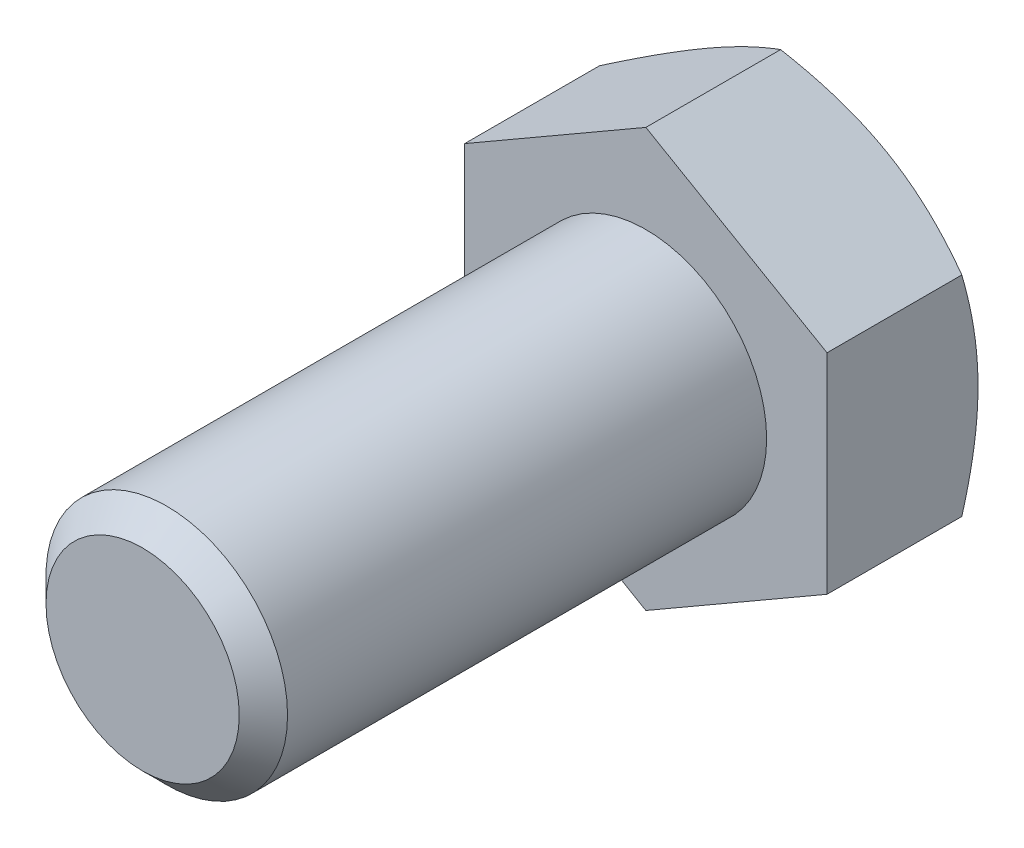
from build123d import *

# Parameters (mm, degrees)
ESQUISSE1_W        = 6
ESQUISSE1_H        = 25
CHANFREIN1_SIZE    = 1.2
BOSS_EXTRU_1_DEPTH = 7.5


with BuildPart() as part:
    # Esquisse1 → Base-R_volution (revolve)
    with BuildSketch(Plane(origin=(0, 0, 0), x_dir=(1, 0, 0), z_dir=(0, 1, 0))):
        with Locations((3, -12.5)):
            Rectangle(ESQUISSE1_W, ESQUISSE1_H)
    revolve(axis=Axis((0, 0, 0), (0, 0, 1)))

    # Chanfrein1
    chanfrein1_edges = [part.edges().sort_by_distance(p)[0] for p in [
        (-6, 0, 25),
    ]]
    chamfer(chanfrein1_edges, length=CHANFREIN1_SIZE)

    # Esquisse6 → Boss.-Extru.1 (add)
    with BuildSketch(Plane.XY):
        Polygon((9, -5.196152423), (9, 5.196152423), (0, 10.392304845), (-9, 5.196152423), (-9, -5.196152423), (0, -10.392304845), align=None)
    extrude(amount=-BOSS_EXTRU_1_DEPTH)

    # Esquisse7 → Enl_vement de mati_re-R_volution1 (revolve, cut)
    with BuildSketch(Plane(origin=(0, 0, 0), x_dir=(1, 0, 0), z_dir=(0, 1, 0))):
        Polygon((-9, 7.5), (-21.990381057, 7.5), (-21.990381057, 0), align=None)
    revolve(axis=Axis((0, 0, -6.239446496), (0, 0, 1)), mode=Mode.SUBTRACT)


solid = part.part
